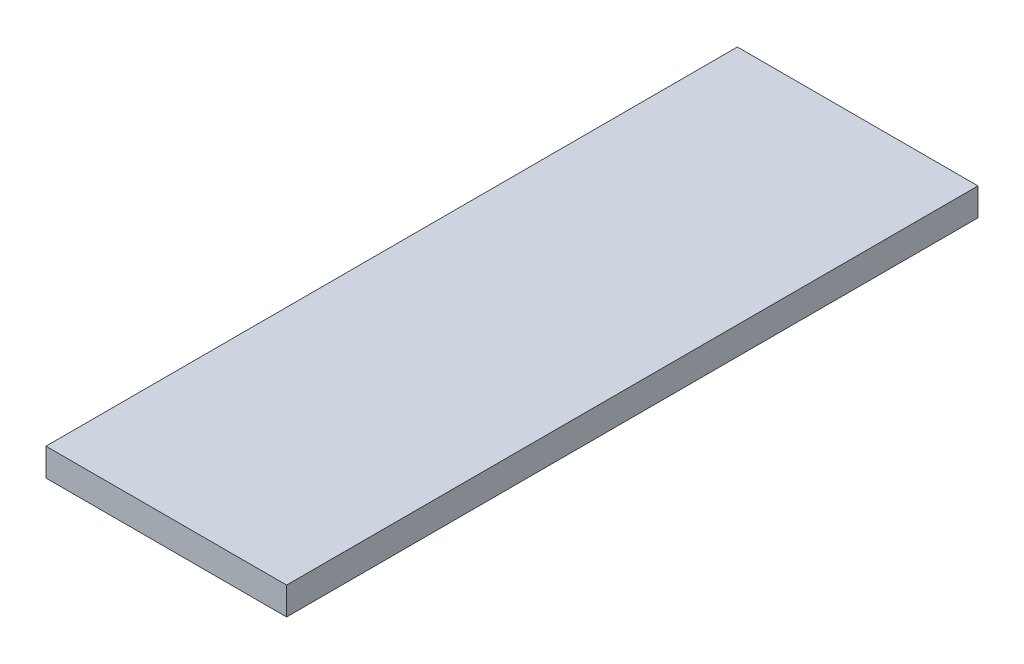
from build123d import *

# Parameters (mm, degrees)
SKETCH1_W           = 8.7
SKETCH1_H           = 25
BOSS_EXTRUDE1_DEPTH = 1


with BuildPart() as part:
    # Sketch1 → Boss-Extrude1 (new body)
    with BuildSketch(Plane(origin=(0, 0, 0), x_dir=(1, 0, 0), z_dir=(0, 1, 0))):
        with Locations((-8.622358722, -3.41031941)):
            Rectangle(SKETCH1_W, SKETCH1_H)
    extrude(amount=BOSS_EXTRUDE1_DEPTH)


solid = part.part
